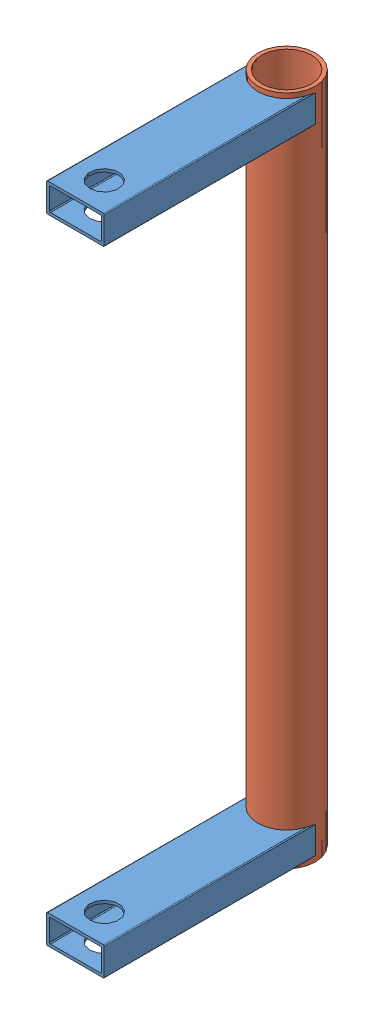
SolidWorks assembly FUT.SLDASM, configuration Défaut (file format 3100). Lengths in mm.
Overall size (60 700 250).
25 component instances, 5 part files, 10 mates.
Components (placement in the parent):
- BRAS FUT-1: BRAS FUT.SLDPRT [Défaut] at (-60 48.1731 -220) size (60 30 220)
- Cylindre fut-1: Cylindre fut.SLDPRT [Défaut] at (-30 -616.8269 -220) x (1 0 0) z (0 1 0) size (60 60 700)
- BRAS FUT-2: BRAS FUT.SLDPRT [Défaut] at (-60 -611.8269 -220) size (60 30 220)
- Roulement_20 52 15-1: Roulement_20 52 15.SLDASM [Défaut] at (-30 13.1731 -220) x (0 1 0) z (0 0 1) size (15 52 52)
  - Roulement_r1rb_Bint48-1: Roulement_r1rb_Bint48.SLDPRT [Défaut] at origin size (15 29.6 29.6)
  - Roulement_r1rb_Bext48-1: Roulement_r1rb_Bext48.SLDPRT [Défaut] at origin size (15 52 52)
  - Roulement_r1rb_Eroul48-1: Roulement_r1rb_Eroul48.SLDPRT [Défaut] at (1.1 0 -11.1) size (9.6 9.6 9.6)
  - Roulement_r1rb_Eroul48-2: Roulement_r1rb_Eroul48.SLDPRT [Défaut] at (1.1 7.8489 -7.8489) x (1 0 0) z (0 -0.707107 0.707107) size (9.6 9.6 9.6)
  - Roulement_r1rb_Eroul48-3: Roulement_r1rb_Eroul48.SLDPRT [Défaut] at (1.1 11.1 0) x (1 0 0) z (0 -1 0) size (9.6 9.6 9.6)
  - Roulement_r1rb_Eroul48-4: Roulement_r1rb_Eroul48.SLDPRT [Défaut] at (1.1 7.8489 7.8489) x (1 0 0) z (0 -0.707107 -0.707107) size (9.6 9.6 9.6)
  - Roulement_r1rb_Eroul48-5: Roulement_r1rb_Eroul48.SLDPRT [Défaut] at (1.1 0 11.1) x (1 0 0) z (0 0 -1) size (9.6 9.6 9.6)
  - Roulement_r1rb_Eroul48-6: Roulement_r1rb_Eroul48.SLDPRT [Défaut] at (1.1 -7.8489 7.8489) x (1 0 0) z (0 0.707107 -0.707107) size (9.6 9.6 9.6)
  - Roulement_r1rb_Eroul48-7: Roulement_r1rb_Eroul48.SLDPRT [Défaut] at (1.1 -11.1 0) x (1 0 0) z (0 1 0) size (9.6 9.6 9.6)
  - Roulement_r1rb_Eroul48-8: Roulement_r1rb_Eroul48.SLDPRT [Défaut] at (1.1 -7.8489 -7.8489) x (1 0 0) z (0 0.707107 0.707107) size (9.6 9.6 9.6)
- Roulement_20 52 15-2: Roulement_20 52 15.SLDASM [Défaut] at (-30 -546.8269 -220) x (0 -1 0) z (0 0 1) size (15 52 52)
  - Roulement_r1rb_Bint48-1: Roulement_r1rb_Bint48.SLDPRT [Défaut] at origin size (15 29.6 29.6)
  - Roulement_r1rb_Bext48-1: Roulement_r1rb_Bext48.SLDPRT [Défaut] at origin size (15 52 52)
  - Roulement_r1rb_Eroul48-1: Roulement_r1rb_Eroul48.SLDPRT [Défaut] at (1.1 0 -11.1) size (9.6 9.6 9.6)
  - Roulement_r1rb_Eroul48-2: Roulement_r1rb_Eroul48.SLDPRT [Défaut] at (1.1 7.8489 -7.8489) x (1 0 0) z (0 -0.707107 0.707107) size (9.6 9.6 9.6)
  - Roulement_r1rb_Eroul48-3: Roulement_r1rb_Eroul48.SLDPRT [Défaut] at (1.1 11.1 0) x (1 0 0) z (0 -1 0) size (9.6 9.6 9.6)
  - Roulement_r1rb_Eroul48-4: Roulement_r1rb_Eroul48.SLDPRT [Défaut] at (1.1 7.8489 7.8489) x (1 0 0) z (0 -0.707107 -0.707107) size (9.6 9.6 9.6)
  - Roulement_r1rb_Eroul48-5: Roulement_r1rb_Eroul48.SLDPRT [Défaut] at (1.1 0 11.1) x (1 0 0) z (0 0 -1) size (9.6 9.6 9.6)
  - Roulement_r1rb_Eroul48-6: Roulement_r1rb_Eroul48.SLDPRT [Défaut] at (1.1 -7.8489 7.8489) x (1 0 0) z (0 0.707107 -0.707107) size (9.6 9.6 9.6)
  - Roulement_r1rb_Eroul48-7: Roulement_r1rb_Eroul48.SLDPRT [Défaut] at (1.1 -11.1 0) x (1 0 0) z (0 1 0) size (9.6 9.6 9.6)
  - Roulement_r1rb_Eroul48-8: Roulement_r1rb_Eroul48.SLDPRT [Défaut] at (1.1 -7.8489 -7.8489) x (1 0 0) z (0 0.707107 0.707107) size (9.6 9.6 9.6)
Mates (geometry in assembly coordinates):
- Coaxiale1: concentric anti-aligned: cylinder of BRAS FUT-1; cylinder of Cylindre fut-1
- Distance1: distance = 5 mm aligned: plane of BRAS FUT-1 through (-59 78.1731 0) normal (0 1 0); plane of Cylindre fut-1 through (-30 83.1731 -220) normal (0 1 0)
- Coaxiale2: concentric anti-aligned: cylinder of Cylindre fut-1; cylinder of BRAS FUT-2
- Distance2: distance = 5 mm aligned: plane of Cylindre fut-1 through (-30 -616.8269 -220) normal (0 -1 0); plane of BRAS FUT-2 through (-59 -611.8269 0) normal (0 -1 0)
- Coïncidente1: coincident aligned: plane of BRAS FUT-2 through (-1 -610.8269 0) normal (0 0 1); plane of assembly
- Coïncidente2: coincident aligned: plane of BRAS FUT-1 through (0 49.1731 0) normal (1 0 0); plane of assembly
- Coïncidente3: coincident: plane of Cylindre fut-1; plane of Roulement_20 52 15-2/Roulement_r1rb_Bext48-1
- Coaxiale3: concentric anti-aligned: cylinder of Cylindre fut-1; cylinder of Roulement_20 52 15-2/Roulement_r1rb_Bext48-1
- Coïncidente4: coincident: plane of Cylindre fut-1; plane of ?
- Coaxiale4: concentric anti-aligned: cylinder of Cylindre fut-1; cylinder of ?
